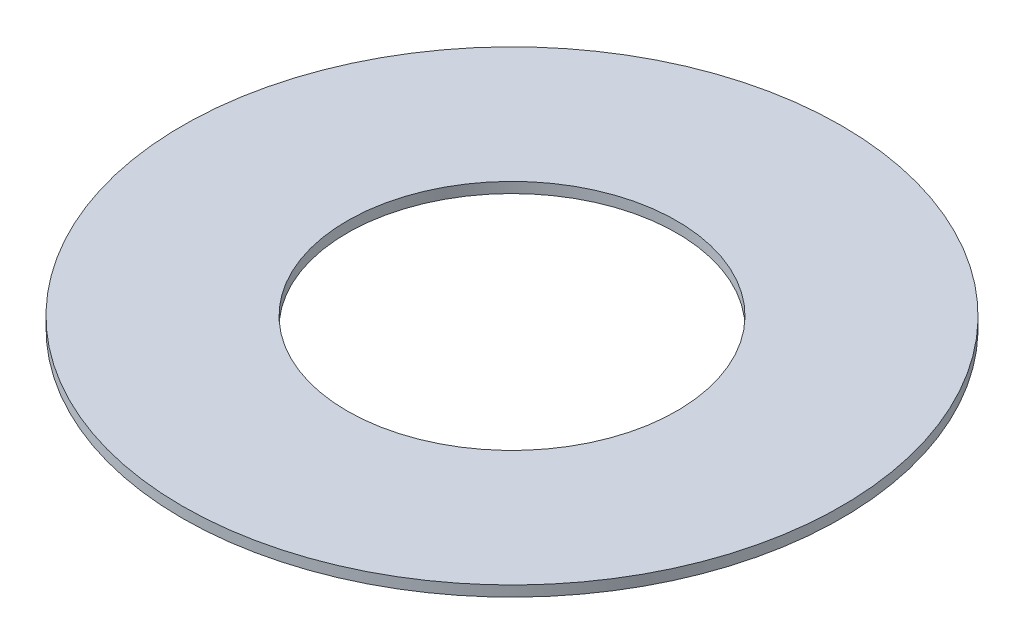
ISO-10303-21;
HEADER;
FILE_DESCRIPTION(('STEP AP214'),'2;1');
FILE_NAME('part.step','',(''),(''),'','','');
FILE_SCHEMA(('AUTOMOTIVE_DESIGN { 1 0 10303 214 1 1 1 1 }'));
ENDSEC;
DATA;
#1=APPLICATION_CONTEXT('core data for automotive mechanical design processes');
#2=APPLICATION_PROTOCOL_DEFINITION('international standard','automotive_design',2000,#1);
#3=PRODUCT_CONTEXT('',#1,'mechanical');
#4=PRODUCT('Part','Part','',(#3));
#5=PRODUCT_RELATED_PRODUCT_CATEGORY('part','',(#4));
#6=PRODUCT_DEFINITION_FORMATION('','',#4);
#7=PRODUCT_DEFINITION_CONTEXT('part definition',#1,'design');
#8=PRODUCT_DEFINITION('design','',#6,#7);
#9=PRODUCT_DEFINITION_SHAPE('','',#8);
#10=(LENGTH_UNIT() NAMED_UNIT(*) SI_UNIT(.MILLI.,.METRE.));
#11=(NAMED_UNIT(*) PLANE_ANGLE_UNIT() SI_UNIT($,.RADIAN.));
#12=(NAMED_UNIT(*) SI_UNIT($,.STERADIAN.) SOLID_ANGLE_UNIT());
#13=UNCERTAINTY_MEASURE_WITH_UNIT(LENGTH_MEASURE(1.E-05),#10,'distance_accuracy_value','');
#14=(GEOMETRIC_REPRESENTATION_CONTEXT(3) GLOBAL_UNCERTAINTY_ASSIGNED_CONTEXT((#13)) GLOBAL_UNIT_ASSIGNED_CONTEXT((#10,
#11,#12)) REPRESENTATION_CONTEXT('',''));
#15=CARTESIAN_POINT('',(0.,0.,0.));
#16=DIRECTION('',(0.,0.,1.));
#17=DIRECTION('',(1.,0.,0.));
#18=AXIS2_PLACEMENT_3D('',#15,#16,#17);
#19=CARTESIAN_POINT('',(0.,0.1016,0.));
#20=DIRECTION('',(0.,-1.,0.));
#21=DIRECTION('',(0.,0.,-1.));
#22=AXIS2_PLACEMENT_3D('',#19,#20,#21);
#23=CYLINDRICAL_SURFACE('',#22,3.175);
#24=CARTESIAN_POINT('',(0.,0.1016,0.));
#25=DIRECTION('',(0.,1.,0.));
#26=DIRECTION('',(0.,0.,1.));
#27=AXIS2_PLACEMENT_3D('',#24,#25,#26);
#28=CIRCLE('',#27,3.175);
#29=CARTESIAN_POINT('',(0.,0.1016,3.175));
#30=VERTEX_POINT('',#29);
#31=EDGE_CURVE('E10',#30,#30,#28,.T.);
#32=ORIENTED_EDGE('',*,*,#31,.F.);
#33=EDGE_LOOP('',(#32));
#34=FACE_BOUND('',#33,.T.);
#35=CARTESIAN_POINT('',(0.,0.,0.));
#36=DIRECTION('',(0.,1.,0.));
#37=DIRECTION('',(0.,0.,1.));
#38=AXIS2_PLACEMENT_3D('',#35,#36,#37);
#39=CIRCLE('',#38,3.175);
#40=CARTESIAN_POINT('',(0.,0.,3.175));
#41=VERTEX_POINT('',#40);
#42=EDGE_CURVE('E42',#41,#41,#39,.T.);
#43=ORIENTED_EDGE('',*,*,#42,.T.);
#44=EDGE_LOOP('',(#43));
#45=FACE_BOUND('',#44,.T.);
#46=ADVANCED_FACE('F39',(#34,#45),#23,.T.);
#47=CARTESIAN_POINT('',(0.,0.1016,0.));
#48=DIRECTION('',(0.,1.,0.));
#49=DIRECTION('',(0.,0.,1.));
#50=AXIS2_PLACEMENT_3D('',#47,#48,#49);
#51=PLANE('',#50);
#52=CARTESIAN_POINT('',(0.,0.1016,0.));
#53=DIRECTION('',(0.,1.,0.));
#54=DIRECTION('',(0.,0.,1.));
#55=AXIS2_PLACEMENT_3D('',#52,#53,#54);
#56=CIRCLE('',#55,1.5875);
#57=CARTESIAN_POINT('',(0.,0.1016,1.5875));
#58=VERTEX_POINT('',#57);
#59=EDGE_CURVE('E53',#58,#58,#56,.T.);
#60=ORIENTED_EDGE('',*,*,#59,.F.);
#61=EDGE_LOOP('',(#60));
#62=FACE_BOUND('',#61,.T.);
#63=ORIENTED_EDGE('',*,*,#31,.T.);
#64=EDGE_LOOP('',(#63));
#65=FACE_BOUND('',#64,.T.);
#66=ADVANCED_FACE('F70',(#62,#65),#51,.T.);
#67=CARTESIAN_POINT('',(0.,0.,0.));
#68=DIRECTION('',(0.,1.,0.));
#69=DIRECTION('',(0.,0.,1.));
#70=AXIS2_PLACEMENT_3D('',#67,#68,#69);
#71=PLANE('',#70);
#72=CARTESIAN_POINT('',(0.,0.,0.));
#73=DIRECTION('',(0.,1.,0.));
#74=DIRECTION('',(0.,0.,1.));
#75=AXIS2_PLACEMENT_3D('',#72,#73,#74);
#76=CIRCLE('',#75,1.5875);
#77=CARTESIAN_POINT('',(0.,0.,1.5875));
#78=VERTEX_POINT('',#77);
#79=EDGE_CURVE('E51',#78,#78,#76,.T.);
#80=ORIENTED_EDGE('',*,*,#79,.T.);
#81=EDGE_LOOP('',(#80));
#82=FACE_BOUND('',#81,.T.);
#83=ORIENTED_EDGE('',*,*,#42,.F.);
#84=EDGE_LOOP('',(#83));
#85=FACE_BOUND('',#84,.T.);
#86=ADVANCED_FACE('F61',(#82,#85),#71,.F.);
#87=CARTESIAN_POINT('',(0.,0.,0.));
#88=DIRECTION('',(0.,1.,0.));
#89=DIRECTION('',(0.,0.,1.));
#90=AXIS2_PLACEMENT_3D('',#87,#88,#89);
#91=CYLINDRICAL_SURFACE('',#90,1.5875);
#92=ORIENTED_EDGE('',*,*,#79,.F.);
#93=EDGE_LOOP('',(#92));
#94=FACE_BOUND('',#93,.T.);
#95=ORIENTED_EDGE('',*,*,#59,.T.);
#96=EDGE_LOOP('',(#95));
#97=FACE_BOUND('',#96,.T.);
#98=ADVANCED_FACE('F64',(#94,#97),#91,.F.);
#99=CLOSED_SHELL('',(#46,#66,#86,#98));
#100=MANIFOLD_SOLID_BREP('B2',#99);
#101=ADVANCED_BREP_SHAPE_REPRESENTATION('',(#18,#100),#14);
#102=SHAPE_DEFINITION_REPRESENTATION(#9,#101);
ENDSEC;
END-ISO-10303-21;
